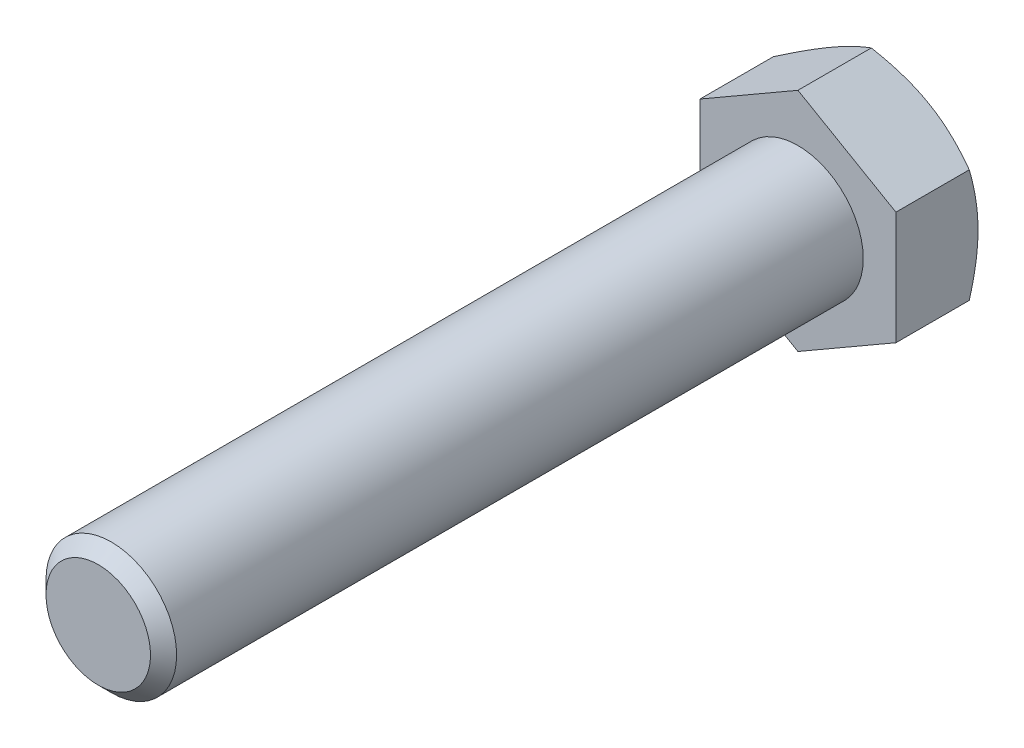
from build123d import *

# Parameters (mm, degrees)
ESQUISSE1_W        = 7
ESQUISSE1_H        = 75
CHANFREIN1_SIZE    = 1.4
BOSS_EXTRU_1_DEPTH = 8.8


with BuildPart() as part:
    # Esquisse1 → Base-R_volution (revolve)
    with BuildSketch(Plane(origin=(0, 0, 0), x_dir=(1, 0, 0), z_dir=(0, 1, 0))):
        with Locations((3.5, -37.5)):
            Rectangle(ESQUISSE1_W, ESQUISSE1_H)
    revolve(axis=Axis((0, 0, 0), (0, 0, 1)))

    # Chanfrein1
    chanfrein1_edges = [part.edges().sort_by_distance(p)[0] for p in [
        (-7, 0, 75),
    ]]
    chamfer(chanfrein1_edges, length=CHANFREIN1_SIZE)

    # Esquisse6 → Boss.-Extru.1 (add)
    with BuildSketch(Plane.XY):
        Polygon((10.5, -6.062177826), (10.5, 6.062177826), (0, 12.124355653), (-10.5, 6.062177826), (-10.5, -6.062177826), (0, -12.124355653), align=None)
    extrude(amount=-BOSS_EXTRU_1_DEPTH)

    # Esquisse7 → Enl_vement de mati_re-R_volution1 (revolve, cut)
    with BuildSketch(Plane(origin=(0, 0, 0), x_dir=(1, 0, 0), z_dir=(0, 1, 0))):
        Polygon((-10.5, 8.8), (-25.742047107, 8.8), (-25.742047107, 0), align=None)
    revolve(axis=Axis((0, 0, -6.239446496), (0, 0, 1)), mode=Mode.SUBTRACT)


solid = part.part
